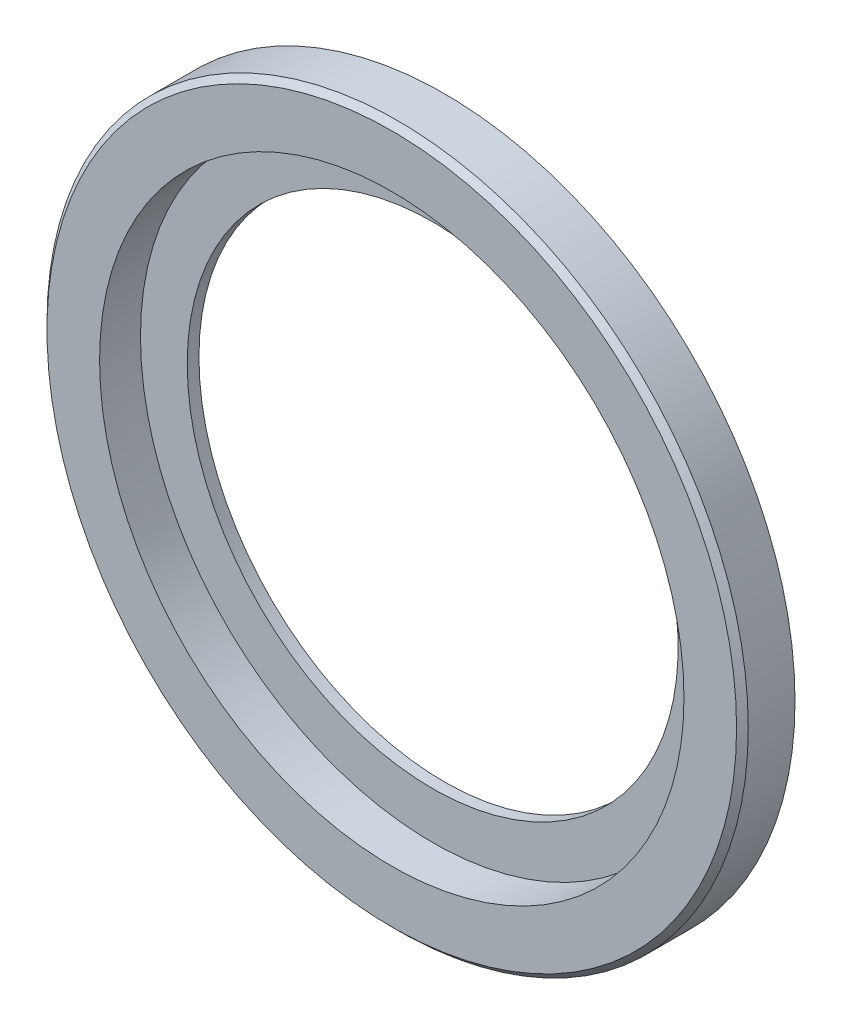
ISO-10303-21;
HEADER;
FILE_DESCRIPTION(('STEP AP214'),'2;1');
FILE_NAME('part.step','',(''),(''),'','','');
FILE_SCHEMA(('AUTOMOTIVE_DESIGN { 1 0 10303 214 1 1 1 1 }'));
ENDSEC;
DATA;
#1=APPLICATION_CONTEXT('core data for automotive mechanical design processes');
#2=APPLICATION_PROTOCOL_DEFINITION('international standard','automotive_design',2000,#1);
#3=PRODUCT_CONTEXT('',#1,'mechanical');
#4=PRODUCT('Part','Part','',(#3));
#5=PRODUCT_RELATED_PRODUCT_CATEGORY('part','',(#4));
#6=PRODUCT_DEFINITION_FORMATION('','',#4);
#7=PRODUCT_DEFINITION_CONTEXT('part definition',#1,'design');
#8=PRODUCT_DEFINITION('design','',#6,#7);
#9=PRODUCT_DEFINITION_SHAPE('','',#8);
#10=(LENGTH_UNIT() NAMED_UNIT(*) SI_UNIT(.MILLI.,.METRE.));
#11=(NAMED_UNIT(*) PLANE_ANGLE_UNIT() SI_UNIT($,.RADIAN.));
#12=(NAMED_UNIT(*) SI_UNIT($,.STERADIAN.) SOLID_ANGLE_UNIT());
#13=UNCERTAINTY_MEASURE_WITH_UNIT(LENGTH_MEASURE(1.E-05),#10,'distance_accuracy_value','');
#14=(GEOMETRIC_REPRESENTATION_CONTEXT(3) GLOBAL_UNCERTAINTY_ASSIGNED_CONTEXT((#13)) GLOBAL_UNIT_ASSIGNED_CONTEXT((#10,
#11,#12)) REPRESENTATION_CONTEXT('',''));
#15=CARTESIAN_POINT('',(0.,0.,0.));
#16=DIRECTION('',(0.,0.,1.));
#17=DIRECTION('',(1.,0.,0.));
#18=AXIS2_PLACEMENT_3D('',#15,#16,#17);
#19=CARTESIAN_POINT('',(0.,0.,9.));
#20=DIRECTION('',(0.,0.,-1.));
#21=DIRECTION('',(-1.,0.,0.));
#22=AXIS2_PLACEMENT_3D('',#19,#20,#21);
#23=CYLINDRICAL_SURFACE('',#22,60.);
#24=CARTESIAN_POINT('',(0.,0.,8.00000000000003));
#25=DIRECTION('',(0.,0.,1.));
#26=DIRECTION('',(1.,0.,0.));
#27=AXIS2_PLACEMENT_3D('',#24,#25,#26);
#28=CIRCLE('',#27,60.);
#29=CARTESIAN_POINT('',(60.,0.,8.00000000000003));
#30=VERTEX_POINT('',#29);
#31=EDGE_CURVE('E11',#30,#30,#28,.F.);
#32=ORIENTED_EDGE('',*,*,#31,.T.);
#33=EDGE_LOOP('',(#32));
#34=FACE_BOUND('',#33,.T.);
#35=CARTESIAN_POINT('',(0.,0.,0.));
#36=DIRECTION('',(0.,0.,1.));
#37=DIRECTION('',(1.,0.,0.));
#38=AXIS2_PLACEMENT_3D('',#35,#36,#37);
#39=CIRCLE('',#38,60.);
#40=CARTESIAN_POINT('',(60.,0.,0.));
#41=VERTEX_POINT('',#40);
#42=EDGE_CURVE('E170',#41,#41,#39,.T.);
#43=ORIENTED_EDGE('',*,*,#42,.T.);
#44=EDGE_LOOP('',(#43));
#45=FACE_BOUND('',#44,.T.);
#46=ADVANCED_FACE('F43',(#34,#45),#23,.T.);
#47=CARTESIAN_POINT('',(0.,0.,9.));
#48=DIRECTION('',(0.,0.,1.));
#49=DIRECTION('',(1.,0.,0.));
#50=AXIS2_PLACEMENT_3D('',#47,#48,#49);
#51=PLANE('',#50);
#52=CARTESIAN_POINT('',(0.,0.,9.));
#53=DIRECTION('',(0.,0.,1.));
#54=DIRECTION('',(1.,0.,0.));
#55=AXIS2_PLACEMENT_3D('',#52,#53,#54);
#56=CIRCLE('',#55,59.);
#57=CARTESIAN_POINT('',(59.,0.,9.));
#58=VERTEX_POINT('',#57);
#59=EDGE_CURVE('E55',#58,#58,#56,.T.);
#60=ORIENTED_EDGE('',*,*,#59,.T.);
#61=EDGE_LOOP('',(#60));
#62=FACE_BOUND('',#61,.T.);
#63=CARTESIAN_POINT('',(0.,0.,9.));
#64=DIRECTION('',(0.,0.,1.));
#65=DIRECTION('',(1.,0.,0.));
#66=AXIS2_PLACEMENT_3D('',#63,#64,#65);
#67=CIRCLE('',#66,50.);
#68=CARTESIAN_POINT('',(50.,0.,9.));
#69=VERTEX_POINT('',#68);
#70=EDGE_CURVE('E161',#69,#69,#67,.T.);
#71=ORIENTED_EDGE('',*,*,#70,.F.);
#72=EDGE_LOOP('',(#71));
#73=FACE_BOUND('',#72,.T.);
#74=ADVANCED_FACE('F174',(#62,#73),#51,.T.);
#75=CARTESIAN_POINT('',(0.,0.,0.));
#76=DIRECTION('',(0.,0.,1.));
#77=DIRECTION('',(1.,0.,0.));
#78=AXIS2_PLACEMENT_3D('',#75,#76,#77);
#79=PLANE('',#78);
#80=CARTESIAN_POINT('',(-38.1837661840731,38.183766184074,0.));
#81=DIRECTION('',(0.,0.,-1.));
#82=DIRECTION('',(-1.,0.,0.));
#83=AXIS2_PLACEMENT_3D('',#80,#81,#82);
#84=CIRCLE('',#83,2.525);
#85=CARTESIAN_POINT('',(-40.7087661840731,38.183766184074,0.));
#86=VERTEX_POINT('',#85);
#87=EDGE_CURVE('E94',#86,#86,#84,.T.);
#88=ORIENTED_EDGE('',*,*,#87,.F.);
#89=EDGE_LOOP('',(#88));
#90=FACE_BOUND('',#89,.T.);
#91=CARTESIAN_POINT('',(-54.,5.65619976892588E-13,0.));
#92=DIRECTION('',(0.,0.,-1.));
#93=DIRECTION('',(-1.,0.,0.));
#94=AXIS2_PLACEMENT_3D('',#91,#92,#93);
#95=CIRCLE('',#94,2.525);
#96=CARTESIAN_POINT('',(-56.525,5.65619976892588E-13,0.));
#97=VERTEX_POINT('',#96);
#98=EDGE_CURVE('E87',#97,#97,#95,.T.);
#99=ORIENTED_EDGE('',*,*,#98,.F.);
#100=EDGE_LOOP('',(#99));
#101=FACE_BOUND('',#100,.T.);
#102=CARTESIAN_POINT('',(-38.1837661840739,-38.1837661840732,0.));
#103=DIRECTION('',(0.,0.,-1.));
#104=DIRECTION('',(-1.,0.,0.));
#105=AXIS2_PLACEMENT_3D('',#102,#103,#104);
#106=CIRCLE('',#105,2.525);
#107=CARTESIAN_POINT('',(-40.7087661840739,-38.1837661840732,0.));
#108=VERTEX_POINT('',#107);
#109=EDGE_CURVE('E103',#108,#108,#106,.T.);
#110=ORIENTED_EDGE('',*,*,#109,.F.);
#111=EDGE_LOOP('',(#110));
#112=FACE_BOUND('',#111,.T.);
#113=CARTESIAN_POINT('',(0.,-54.,0.));
#114=DIRECTION('',(0.,0.,-1.));
#115=DIRECTION('',(-1.,0.,0.));
#116=AXIS2_PLACEMENT_3D('',#113,#114,#115);
#117=CIRCLE('',#116,2.525);
#118=CARTESIAN_POINT('',(-2.525,-54.,0.));
#119=VERTEX_POINT('',#118);
#120=EDGE_CURVE('E115',#119,#119,#117,.T.);
#121=ORIENTED_EDGE('',*,*,#120,.F.);
#122=EDGE_LOOP('',(#121));
#123=FACE_BOUND('',#122,.T.);
#124=CARTESIAN_POINT('',(38.1837661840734,-38.1837661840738,0.));
#125=DIRECTION('',(0.,0.,-1.));
#126=DIRECTION('',(-1.,0.,0.));
#127=AXIS2_PLACEMENT_3D('',#124,#125,#126);
#128=CIRCLE('',#127,2.525);
#129=CARTESIAN_POINT('',(35.6587661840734,-38.1837661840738,0.));
#130=VERTEX_POINT('',#129);
#131=EDGE_CURVE('E124',#130,#130,#128,.T.);
#132=ORIENTED_EDGE('',*,*,#131,.F.);
#133=EDGE_LOOP('',(#132));
#134=FACE_BOUND('',#133,.T.);
#135=CARTESIAN_POINT('',(54.,-1.88539992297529E-13,0.));
#136=DIRECTION('',(0.,0.,-1.));
#137=DIRECTION('',(-1.,0.,0.));
#138=AXIS2_PLACEMENT_3D('',#135,#136,#137);
#139=CIRCLE('',#138,2.525);
#140=CARTESIAN_POINT('',(51.475,-1.88539992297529E-13,0.));
#141=VERTEX_POINT('',#140);
#142=EDGE_CURVE('E128',#141,#141,#139,.T.);
#143=ORIENTED_EDGE('',*,*,#142,.F.);
#144=EDGE_LOOP('',(#143));
#145=FACE_BOUND('',#144,.T.);
#146=CARTESIAN_POINT('',(38.1837661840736,38.1837661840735,0.));
#147=DIRECTION('',(0.,0.,-1.));
#148=DIRECTION('',(-1.,0.,0.));
#149=AXIS2_PLACEMENT_3D('',#146,#147,#148);
#150=CIRCLE('',#149,2.525);
#151=CARTESIAN_POINT('',(35.6587661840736,38.1837661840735,0.));
#152=VERTEX_POINT('',#151);
#153=EDGE_CURVE('E138',#152,#152,#150,.T.);
#154=ORIENTED_EDGE('',*,*,#153,.F.);
#155=EDGE_LOOP('',(#154));
#156=FACE_BOUND('',#155,.T.);
#157=CARTESIAN_POINT('',(0.,54.,0.));
#158=DIRECTION('',(0.,0.,-1.));
#159=DIRECTION('',(-1.,0.,0.));
#160=AXIS2_PLACEMENT_3D('',#157,#158,#159);
#161=CIRCLE('',#160,2.525);
#162=CARTESIAN_POINT('',(-2.525,54.,0.));
#163=VERTEX_POINT('',#162);
#164=EDGE_CURVE('E146',#163,#163,#161,.T.);
#165=ORIENTED_EDGE('',*,*,#164,.F.);
#166=EDGE_LOOP('',(#165));
#167=FACE_BOUND('',#166,.T.);
#168=CARTESIAN_POINT('',(0.,0.,0.));
#169=DIRECTION('',(0.,0.,-1.));
#170=DIRECTION('',(-1.,0.,0.));
#171=AXIS2_PLACEMENT_3D('',#168,#169,#170);
#172=CIRCLE('',#171,42.);
#173=CARTESIAN_POINT('',(-42.,0.,0.));
#174=VERTEX_POINT('',#173);
#175=EDGE_CURVE('E160',#174,#174,#172,.T.);
#176=ORIENTED_EDGE('',*,*,#175,.F.);
#177=EDGE_LOOP('',(#176));
#178=FACE_BOUND('',#177,.T.);
#179=ORIENTED_EDGE('',*,*,#42,.F.);
#180=EDGE_LOOP('',(#179));
#181=FACE_BOUND('',#180,.T.);
#182=ADVANCED_FACE('F198',(#90,#101,#112,#123,#134,#145,#156,#167,#178,#181),#79,.F.);
#183=CARTESIAN_POINT('',(0.,0.,2.));
#184=DIRECTION('',(0.,0.,1.));
#185=DIRECTION('',(1.,0.,0.));
#186=AXIS2_PLACEMENT_3D('',#183,#184,#185);
#187=CYLINDRICAL_SURFACE('',#186,50.);
#188=CARTESIAN_POINT('',(0.,0.,2.));
#189=DIRECTION('',(0.,0.,1.));
#190=DIRECTION('',(1.,0.,0.));
#191=AXIS2_PLACEMENT_3D('',#188,#189,#190);
#192=CIRCLE('',#191,50.);
#193=CARTESIAN_POINT('',(50.,0.,2.));
#194=VERTEX_POINT('',#193);
#195=EDGE_CURVE('E163',#194,#194,#192,.T.);
#196=ORIENTED_EDGE('',*,*,#195,.F.);
#197=EDGE_LOOP('',(#196));
#198=FACE_BOUND('',#197,.T.);
#199=ORIENTED_EDGE('',*,*,#70,.T.);
#200=EDGE_LOOP('',(#199));
#201=FACE_BOUND('',#200,.T.);
#202=ADVANCED_FACE('F203',(#198,#201),#187,.F.);
#203=CARTESIAN_POINT('',(0.,0.,2.));
#204=DIRECTION('',(0.,0.,1.));
#205=DIRECTION('',(1.,0.,0.));
#206=AXIS2_PLACEMENT_3D('',#203,#204,#205);
#207=PLANE('',#206);
#208=CARTESIAN_POINT('',(0.,0.,2.));
#209=DIRECTION('',(0.,0.,-1.));
#210=DIRECTION('',(-1.,0.,0.));
#211=AXIS2_PLACEMENT_3D('',#208,#209,#210);
#212=CIRCLE('',#211,42.);
#213=CARTESIAN_POINT('',(-42.,0.,2.));
#214=VERTEX_POINT('',#213);
#215=EDGE_CURVE('E158',#214,#214,#212,.T.);
#216=ORIENTED_EDGE('',*,*,#215,.T.);
#217=EDGE_LOOP('',(#216));
#218=FACE_BOUND('',#217,.T.);
#219=ORIENTED_EDGE('',*,*,#195,.T.);
#220=EDGE_LOOP('',(#219));
#221=FACE_BOUND('',#220,.T.);
#222=ADVANCED_FACE('F186',(#218,#221),#207,.T.);
#223=CARTESIAN_POINT('',(0.,0.,2.));
#224=DIRECTION('',(0.,0.,-1.));
#225=DIRECTION('',(-1.,0.,0.));
#226=AXIS2_PLACEMENT_3D('',#223,#224,#225);
#227=CYLINDRICAL_SURFACE('',#226,42.);
#228=ORIENTED_EDGE('',*,*,#215,.F.);
#229=EDGE_LOOP('',(#228));
#230=FACE_BOUND('',#229,.T.);
#231=ORIENTED_EDGE('',*,*,#175,.T.);
#232=EDGE_LOOP('',(#231));
#233=FACE_BOUND('',#232,.T.);
#234=ADVANCED_FACE('F178',(#230,#233),#227,.F.);
#235=CARTESIAN_POINT('',(0.,0.,9.));
#236=DIRECTION('',(0.,0.,-1.));
#237=DIRECTION('',(-1.,0.,0.));
#238=AXIS2_PLACEMENT_3D('',#235,#236,#237);
#239=CONICAL_SURFACE('',#238,59.,0.785398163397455);
#240=ORIENTED_EDGE('',*,*,#31,.F.);
#241=EDGE_LOOP('',(#240));
#242=FACE_BOUND('',#241,.T.);
#243=ORIENTED_EDGE('',*,*,#59,.F.);
#244=EDGE_LOOP('',(#243));
#245=FACE_BOUND('',#244,.T.);
#246=ADVANCED_FACE('F46',(#242,#245),#239,.T.);
#247=CARTESIAN_POINT('',(0.,54.,6.));
#248=DIRECTION('',(0.,0.,-1.));
#249=DIRECTION('',(-1.,0.,0.));
#250=AXIS2_PLACEMENT_3D('',#247,#248,#249);
#251=CONICAL_SURFACE('',#250,2.5,1.02974425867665);
#252=CARTESIAN_POINT('',(0.,54.,7.5021515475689));
#253=VERTEX_POINT('',#252);
#254=VERTEX_LOOP('',#253);
#255=FACE_BOUND('',#254,.T.);
#256=CARTESIAN_POINT('',(0.,54.,6.));
#257=DIRECTION('',(0.,0.,-1.));
#258=DIRECTION('',(-1.,0.,0.));
#259=AXIS2_PLACEMENT_3D('',#256,#257,#258);
#260=CIRCLE('',#259,2.5);
#261=CARTESIAN_POINT('',(-2.5,54.,6.));
#262=VERTEX_POINT('',#261);
#263=EDGE_CURVE('E152',#262,#262,#260,.T.);
#264=ORIENTED_EDGE('',*,*,#263,.T.);
#265=EDGE_LOOP('',(#264));
#266=FACE_BOUND('',#265,.T.);
#267=ADVANCED_FACE('F180',(#255,#266),#251,.F.);
#268=CARTESIAN_POINT('',(0.,54.,0.));
#269=DIRECTION('',(0.,0.,-1.));
#270=DIRECTION('',(-1.,0.,0.));
#271=AXIS2_PLACEMENT_3D('',#268,#269,#270);
#272=CYLINDRICAL_SURFACE('',#271,2.5);
#273=ORIENTED_EDGE('',*,*,#263,.F.);
#274=EDGE_LOOP('',(#273));
#275=FACE_BOUND('',#274,.T.);
#276=CARTESIAN_POINT('',(0.,54.,0.0250000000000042));
#277=DIRECTION('',(0.,0.,-1.));
#278=DIRECTION('',(-1.,0.,0.));
#279=AXIS2_PLACEMENT_3D('',#276,#277,#278);
#280=CIRCLE('',#279,2.5);
#281=CARTESIAN_POINT('',(-2.5,54.,0.0250000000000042));
#282=VERTEX_POINT('',#281);
#283=EDGE_CURVE('E151',#282,#282,#280,.T.);
#284=ORIENTED_EDGE('',*,*,#283,.T.);
#285=EDGE_LOOP('',(#284));
#286=FACE_BOUND('',#285,.T.);
#287=ADVANCED_FACE('F183',(#275,#286),#272,.F.);
#288=CARTESIAN_POINT('',(0.,54.,0.));
#289=DIRECTION('',(0.,0.,-1.));
#290=DIRECTION('',(-1.,0.,0.));
#291=AXIS2_PLACEMENT_3D('',#288,#289,#290);
#292=CONICAL_SURFACE('',#291,2.525,0.785398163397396);
#293=ORIENTED_EDGE('',*,*,#283,.F.);
#294=EDGE_LOOP('',(#293));
#295=FACE_BOUND('',#294,.T.);
#296=ORIENTED_EDGE('',*,*,#164,.T.);
#297=EDGE_LOOP('',(#296));
#298=FACE_BOUND('',#297,.T.);
#299=ADVANCED_FACE('F215',(#295,#298),#292,.F.);
#300=CARTESIAN_POINT('',(38.1837661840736,38.1837661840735,6.));
#301=DIRECTION('',(0.,0.,-1.));
#302=DIRECTION('',(-1.,0.,0.));
#303=AXIS2_PLACEMENT_3D('',#300,#301,#302);
#304=CONICAL_SURFACE('',#303,2.5,1.02974425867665);
#305=CARTESIAN_POINT('',(38.1837661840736,38.1837661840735,7.5021515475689));
#306=VERTEX_POINT('',#305);
#307=VERTEX_LOOP('',#306);
#308=FACE_BOUND('',#307,.T.);
#309=CARTESIAN_POINT('',(38.1837661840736,38.1837661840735,6.));
#310=DIRECTION('',(0.,0.,-1.));
#311=DIRECTION('',(-1.,0.,0.));
#312=AXIS2_PLACEMENT_3D('',#309,#310,#311);
#313=CIRCLE('',#312,2.5);
#314=CARTESIAN_POINT('',(35.6837661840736,38.1837661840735,6.));
#315=VERTEX_POINT('',#314);
#316=EDGE_CURVE('E144',#315,#315,#313,.T.);
#317=ORIENTED_EDGE('',*,*,#316,.T.);
#318=EDGE_LOOP('',(#317));
#319=FACE_BOUND('',#318,.T.);
#320=ADVANCED_FACE('F216',(#308,#319),#304,.F.);
#321=CARTESIAN_POINT('',(38.1837661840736,38.1837661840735,0.));
#322=DIRECTION('',(0.,0.,-1.));
#323=DIRECTION('',(-1.,0.,0.));
#324=AXIS2_PLACEMENT_3D('',#321,#322,#323);
#325=CYLINDRICAL_SURFACE('',#324,2.5);
#326=ORIENTED_EDGE('',*,*,#316,.F.);
#327=EDGE_LOOP('',(#326));
#328=FACE_BOUND('',#327,.T.);
#329=CARTESIAN_POINT('',(38.1837661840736,38.1837661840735,0.0250000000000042));
#330=DIRECTION('',(0.,0.,-1.));
#331=DIRECTION('',(-1.,0.,0.));
#332=AXIS2_PLACEMENT_3D('',#329,#330,#331);
#333=CIRCLE('',#332,2.5);
#334=CARTESIAN_POINT('',(35.6837661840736,38.1837661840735,0.0250000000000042));
#335=VERTEX_POINT('',#334);
#336=EDGE_CURVE('E142',#335,#335,#333,.T.);
#337=ORIENTED_EDGE('',*,*,#336,.T.);
#338=EDGE_LOOP('',(#337));
#339=FACE_BOUND('',#338,.T.);
#340=ADVANCED_FACE('F219',(#328,#339),#325,.F.);
#341=CARTESIAN_POINT('',(38.1837661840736,38.1837661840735,0.));
#342=DIRECTION('',(0.,0.,-1.));
#343=DIRECTION('',(-1.,0.,0.));
#344=AXIS2_PLACEMENT_3D('',#341,#342,#343);
#345=CONICAL_SURFACE('',#344,2.525,0.785398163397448);
#346=ORIENTED_EDGE('',*,*,#336,.F.);
#347=EDGE_LOOP('',(#346));
#348=FACE_BOUND('',#347,.T.);
#349=ORIENTED_EDGE('',*,*,#153,.T.);
#350=EDGE_LOOP('',(#349));
#351=FACE_BOUND('',#350,.T.);
#352=ADVANCED_FACE('F224',(#348,#351),#345,.F.);
#353=CARTESIAN_POINT('',(54.,-1.88539992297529E-13,6.));
#354=DIRECTION('',(0.,0.,-1.));
#355=DIRECTION('',(-1.,0.,0.));
#356=AXIS2_PLACEMENT_3D('',#353,#354,#355);
#357=CONICAL_SURFACE('',#356,2.5,1.02974425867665);
#358=CARTESIAN_POINT('',(54.,-1.88539992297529E-13,7.5021515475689));
#359=VERTEX_POINT('',#358);
#360=VERTEX_LOOP('',#359);
#361=FACE_BOUND('',#360,.T.);
#362=CARTESIAN_POINT('',(54.,-1.88539992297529E-13,6.));
#363=DIRECTION('',(0.,0.,-1.));
#364=DIRECTION('',(-1.,0.,0.));
#365=AXIS2_PLACEMENT_3D('',#362,#363,#364);
#366=CIRCLE('',#365,2.5);
#367=CARTESIAN_POINT('',(51.5,-1.88539992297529E-13,6.));
#368=VERTEX_POINT('',#367);
#369=EDGE_CURVE('E139',#368,#368,#366,.T.);
#370=ORIENTED_EDGE('',*,*,#369,.T.);
#371=EDGE_LOOP('',(#370));
#372=FACE_BOUND('',#371,.T.);
#373=ADVANCED_FACE('F230',(#361,#372),#357,.F.);
#374=CARTESIAN_POINT('',(54.,-1.88539992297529E-13,0.));
#375=DIRECTION('',(0.,0.,-1.));
#376=DIRECTION('',(-1.,0.,0.));
#377=AXIS2_PLACEMENT_3D('',#374,#375,#376);
#378=CYLINDRICAL_SURFACE('',#377,2.5);
#379=ORIENTED_EDGE('',*,*,#369,.F.);
#380=EDGE_LOOP('',(#379));
#381=FACE_BOUND('',#380,.T.);
#382=CARTESIAN_POINT('',(54.,-1.88539992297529E-13,0.0250000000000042));
#383=DIRECTION('',(0.,0.,-1.));
#384=DIRECTION('',(-1.,0.,0.));
#385=AXIS2_PLACEMENT_3D('',#382,#383,#384);
#386=CIRCLE('',#385,2.5);
#387=CARTESIAN_POINT('',(51.5,-1.88539992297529E-13,0.0250000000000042));
#388=VERTEX_POINT('',#387);
#389=EDGE_CURVE('E131',#388,#388,#386,.T.);
#390=ORIENTED_EDGE('',*,*,#389,.T.);
#391=EDGE_LOOP('',(#390));
#392=FACE_BOUND('',#391,.T.);
#393=ADVANCED_FACE('F234',(#381,#392),#378,.F.);
#394=CARTESIAN_POINT('',(54.,-1.88539992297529E-13,0.));
#395=DIRECTION('',(0.,0.,-1.));
#396=DIRECTION('',(-1.,0.,0.));
#397=AXIS2_PLACEMENT_3D('',#394,#395,#396);
#398=CONICAL_SURFACE('',#397,2.525,0.785398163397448);
#399=ORIENTED_EDGE('',*,*,#389,.F.);
#400=EDGE_LOOP('',(#399));
#401=FACE_BOUND('',#400,.T.);
#402=ORIENTED_EDGE('',*,*,#142,.T.);
#403=EDGE_LOOP('',(#402));
#404=FACE_BOUND('',#403,.T.);
#405=ADVANCED_FACE('F232',(#401,#404),#398,.F.);
#406=CARTESIAN_POINT('',(38.1837661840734,-38.1837661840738,6.));
#407=DIRECTION('',(0.,0.,-1.));
#408=DIRECTION('',(-1.,0.,0.));
#409=AXIS2_PLACEMENT_3D('',#406,#407,#408);
#410=CONICAL_SURFACE('',#409,2.5,1.02974425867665);
#411=CARTESIAN_POINT('',(38.1837661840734,-38.1837661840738,7.5021515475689));
#412=VERTEX_POINT('',#411);
#413=VERTEX_LOOP('',#412);
#414=FACE_BOUND('',#413,.T.);
#415=CARTESIAN_POINT('',(38.1837661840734,-38.1837661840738,6.));
#416=DIRECTION('',(0.,0.,-1.));
#417=DIRECTION('',(-1.,0.,0.));
#418=AXIS2_PLACEMENT_3D('',#415,#416,#417);
#419=CIRCLE('',#418,2.5);
#420=CARTESIAN_POINT('',(35.6837661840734,-38.1837661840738,6.));
#421=VERTEX_POINT('',#420);
#422=EDGE_CURVE('E130',#421,#421,#419,.T.);
#423=ORIENTED_EDGE('',*,*,#422,.T.);
#424=EDGE_LOOP('',(#423));
#425=FACE_BOUND('',#424,.T.);
#426=ADVANCED_FACE('F239',(#414,#425),#410,.F.);
#427=CARTESIAN_POINT('',(38.1837661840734,-38.1837661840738,0.));
#428=DIRECTION('',(0.,0.,-1.));
#429=DIRECTION('',(-1.,0.,0.));
#430=AXIS2_PLACEMENT_3D('',#427,#428,#429);
#431=CYLINDRICAL_SURFACE('',#430,2.5);
#432=ORIENTED_EDGE('',*,*,#422,.F.);
#433=EDGE_LOOP('',(#432));
#434=FACE_BOUND('',#433,.T.);
#435=CARTESIAN_POINT('',(38.1837661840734,-38.1837661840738,0.0250000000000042));
#436=DIRECTION('',(0.,0.,-1.));
#437=DIRECTION('',(-1.,0.,0.));
#438=AXIS2_PLACEMENT_3D('',#435,#436,#437);
#439=CIRCLE('',#438,2.5);
#440=CARTESIAN_POINT('',(35.6837661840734,-38.1837661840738,0.0250000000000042));
#441=VERTEX_POINT('',#440);
#442=EDGE_CURVE('E123',#441,#441,#439,.T.);
#443=ORIENTED_EDGE('',*,*,#442,.T.);
#444=EDGE_LOOP('',(#443));
#445=FACE_BOUND('',#444,.T.);
#446=ADVANCED_FACE('F241',(#434,#445),#431,.F.);
#447=CARTESIAN_POINT('',(38.1837661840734,-38.1837661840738,0.));
#448=DIRECTION('',(0.,0.,-1.));
#449=DIRECTION('',(-1.,0.,0.));
#450=AXIS2_PLACEMENT_3D('',#447,#448,#449);
#451=CONICAL_SURFACE('',#450,2.525,0.785398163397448);
#452=ORIENTED_EDGE('',*,*,#442,.F.);
#453=EDGE_LOOP('',(#452));
#454=FACE_BOUND('',#453,.T.);
#455=ORIENTED_EDGE('',*,*,#131,.T.);
#456=EDGE_LOOP('',(#455));
#457=FACE_BOUND('',#456,.T.);
#458=ADVANCED_FACE('F246',(#454,#457),#451,.F.);
#459=CARTESIAN_POINT('',(0.,-54.,6.));
#460=DIRECTION('',(0.,0.,-1.));
#461=DIRECTION('',(-1.,0.,0.));
#462=AXIS2_PLACEMENT_3D('',#459,#460,#461);
#463=CONICAL_SURFACE('',#462,2.5,1.02974425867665);
#464=CARTESIAN_POINT('',(0.,-54.,7.5021515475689));
#465=VERTEX_POINT('',#464);
#466=VERTEX_LOOP('',#465);
#467=FACE_BOUND('',#466,.T.);
#468=CARTESIAN_POINT('',(0.,-54.,6.));
#469=DIRECTION('',(0.,0.,-1.));
#470=DIRECTION('',(-1.,0.,0.));
#471=AXIS2_PLACEMENT_3D('',#468,#469,#470);
#472=CIRCLE('',#471,2.5);
#473=CARTESIAN_POINT('',(-2.5,-54.,6.));
#474=VERTEX_POINT('',#473);
#475=EDGE_CURVE('E116',#474,#474,#472,.T.);
#476=ORIENTED_EDGE('',*,*,#475,.T.);
#477=EDGE_LOOP('',(#476));
#478=FACE_BOUND('',#477,.T.);
#479=ADVANCED_FACE('F253',(#467,#478),#463,.F.);
#480=CARTESIAN_POINT('',(0.,-54.,0.));
#481=DIRECTION('',(0.,0.,-1.));
#482=DIRECTION('',(-1.,0.,0.));
#483=AXIS2_PLACEMENT_3D('',#480,#481,#482);
#484=CYLINDRICAL_SURFACE('',#483,2.5);
#485=ORIENTED_EDGE('',*,*,#475,.F.);
#486=EDGE_LOOP('',(#485));
#487=FACE_BOUND('',#486,.T.);
#488=CARTESIAN_POINT('',(0.,-54.,0.0250000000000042));
#489=DIRECTION('',(0.,0.,-1.));
#490=DIRECTION('',(-1.,0.,0.));
#491=AXIS2_PLACEMENT_3D('',#488,#489,#490);
#492=CIRCLE('',#491,2.5);
#493=CARTESIAN_POINT('',(-2.5,-54.,0.0250000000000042));
#494=VERTEX_POINT('',#493);
#495=EDGE_CURVE('E113',#494,#494,#492,.T.);
#496=ORIENTED_EDGE('',*,*,#495,.T.);
#497=EDGE_LOOP('',(#496));
#498=FACE_BOUND('',#497,.T.);
#499=ADVANCED_FACE('F254',(#487,#498),#484,.F.);
#500=CARTESIAN_POINT('',(0.,-54.,0.));
#501=DIRECTION('',(0.,0.,-1.));
#502=DIRECTION('',(-1.,0.,0.));
#503=AXIS2_PLACEMENT_3D('',#500,#501,#502);
#504=CONICAL_SURFACE('',#503,2.525,0.785398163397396);
#505=ORIENTED_EDGE('',*,*,#495,.F.);
#506=EDGE_LOOP('',(#505));
#507=FACE_BOUND('',#506,.T.);
#508=ORIENTED_EDGE('',*,*,#120,.T.);
#509=EDGE_LOOP('',(#508));
#510=FACE_BOUND('',#509,.T.);
#511=ADVANCED_FACE('F259',(#507,#510),#504,.F.);
#512=CARTESIAN_POINT('',(-38.1837661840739,-38.1837661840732,6.));
#513=DIRECTION('',(0.,0.,-1.));
#514=DIRECTION('',(-1.,0.,0.));
#515=AXIS2_PLACEMENT_3D('',#512,#513,#514);
#516=CONICAL_SURFACE('',#515,2.5,1.02974425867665);
#517=CARTESIAN_POINT('',(-38.1837661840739,-38.1837661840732,7.5021515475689));
#518=VERTEX_POINT('',#517);
#519=VERTEX_LOOP('',#518);
#520=FACE_BOUND('',#519,.T.);
#521=CARTESIAN_POINT('',(-38.1837661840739,-38.1837661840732,6.));
#522=DIRECTION('',(0.,0.,-1.));
#523=DIRECTION('',(-1.,0.,0.));
#524=AXIS2_PLACEMENT_3D('',#521,#522,#523);
#525=CIRCLE('',#524,2.5);
#526=CARTESIAN_POINT('',(-40.6837661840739,-38.1837661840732,6.));
#527=VERTEX_POINT('',#526);
#528=EDGE_CURVE('E108',#527,#527,#525,.T.);
#529=ORIENTED_EDGE('',*,*,#528,.T.);
#530=EDGE_LOOP('',(#529));
#531=FACE_BOUND('',#530,.T.);
#532=ADVANCED_FACE('F263',(#520,#531),#516,.F.);
#533=CARTESIAN_POINT('',(-38.1837661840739,-38.1837661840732,0.));
#534=DIRECTION('',(0.,0.,-1.));
#535=DIRECTION('',(-1.,0.,0.));
#536=AXIS2_PLACEMENT_3D('',#533,#534,#535);
#537=CYLINDRICAL_SURFACE('',#536,2.5);
#538=ORIENTED_EDGE('',*,*,#528,.F.);
#539=EDGE_LOOP('',(#538));
#540=FACE_BOUND('',#539,.T.);
#541=CARTESIAN_POINT('',(-38.1837661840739,-38.1837661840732,0.0250000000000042));
#542=DIRECTION('',(0.,0.,-1.));
#543=DIRECTION('',(-1.,0.,0.));
#544=AXIS2_PLACEMENT_3D('',#541,#542,#543);
#545=CIRCLE('',#544,2.5);
#546=CARTESIAN_POINT('',(-40.6837661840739,-38.1837661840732,0.0250000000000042));
#547=VERTEX_POINT('',#546);
#548=EDGE_CURVE('E106',#547,#547,#545,.T.);
#549=ORIENTED_EDGE('',*,*,#548,.T.);
#550=EDGE_LOOP('',(#549));
#551=FACE_BOUND('',#550,.T.);
#552=ADVANCED_FACE('F270',(#540,#551),#537,.F.);
#553=CARTESIAN_POINT('',(-38.1837661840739,-38.1837661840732,0.));
#554=DIRECTION('',(0.,0.,-1.));
#555=DIRECTION('',(-1.,0.,0.));
#556=AXIS2_PLACEMENT_3D('',#553,#554,#555);
#557=CONICAL_SURFACE('',#556,2.525,0.785398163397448);
#558=ORIENTED_EDGE('',*,*,#548,.F.);
#559=EDGE_LOOP('',(#558));
#560=FACE_BOUND('',#559,.T.);
#561=ORIENTED_EDGE('',*,*,#109,.T.);
#562=EDGE_LOOP('',(#561));
#563=FACE_BOUND('',#562,.T.);
#564=ADVANCED_FACE('F271',(#560,#563),#557,.F.);
#565=CARTESIAN_POINT('',(-54.,5.65619976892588E-13,6.));
#566=DIRECTION('',(0.,0.,-1.));
#567=DIRECTION('',(-1.,0.,0.));
#568=AXIS2_PLACEMENT_3D('',#565,#566,#567);
#569=CONICAL_SURFACE('',#568,2.5,1.02974425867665);
#570=CARTESIAN_POINT('',(-54.,5.65619976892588E-13,7.5021515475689));
#571=VERTEX_POINT('',#570);
#572=VERTEX_LOOP('',#571);
#573=FACE_BOUND('',#572,.T.);
#574=CARTESIAN_POINT('',(-54.,5.65619976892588E-13,6.));
#575=DIRECTION('',(0.,0.,-1.));
#576=DIRECTION('',(-1.,0.,0.));
#577=AXIS2_PLACEMENT_3D('',#574,#575,#576);
#578=CIRCLE('',#577,2.5);
#579=CARTESIAN_POINT('',(-56.5,5.65619976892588E-13,6.));
#580=VERTEX_POINT('',#579);
#581=EDGE_CURVE('E99',#580,#580,#578,.T.);
#582=ORIENTED_EDGE('',*,*,#581,.T.);
#583=EDGE_LOOP('',(#582));
#584=FACE_BOUND('',#583,.T.);
#585=ADVANCED_FACE('F274',(#573,#584),#569,.F.);
#586=CARTESIAN_POINT('',(-54.,5.65619976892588E-13,0.));
#587=DIRECTION('',(0.,0.,-1.));
#588=DIRECTION('',(-1.,0.,0.));
#589=AXIS2_PLACEMENT_3D('',#586,#587,#588);
#590=CYLINDRICAL_SURFACE('',#589,2.5);
#591=ORIENTED_EDGE('',*,*,#581,.F.);
#592=EDGE_LOOP('',(#591));
#593=FACE_BOUND('',#592,.T.);
#594=CARTESIAN_POINT('',(-54.,5.65619976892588E-13,0.0250000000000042));
#595=DIRECTION('',(0.,0.,-1.));
#596=DIRECTION('',(-1.,0.,0.));
#597=AXIS2_PLACEMENT_3D('',#594,#595,#596);
#598=CIRCLE('',#597,2.5);
#599=CARTESIAN_POINT('',(-56.5,5.65619976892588E-13,0.0250000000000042));
#600=VERTEX_POINT('',#599);
#601=EDGE_CURVE('E93',#600,#600,#598,.T.);
#602=ORIENTED_EDGE('',*,*,#601,.T.);
#603=EDGE_LOOP('',(#602));
#604=FACE_BOUND('',#603,.T.);
#605=ADVANCED_FACE('F276',(#593,#604),#590,.F.);
#606=CARTESIAN_POINT('',(-54.,5.65619976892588E-13,0.));
#607=DIRECTION('',(0.,0.,-1.));
#608=DIRECTION('',(-1.,0.,0.));
#609=AXIS2_PLACEMENT_3D('',#606,#607,#608);
#610=CONICAL_SURFACE('',#609,2.525,0.785398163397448);
#611=ORIENTED_EDGE('',*,*,#601,.F.);
#612=EDGE_LOOP('',(#611));
#613=FACE_BOUND('',#612,.T.);
#614=ORIENTED_EDGE('',*,*,#98,.T.);
#615=EDGE_LOOP('',(#614));
#616=FACE_BOUND('',#615,.T.);
#617=ADVANCED_FACE('F84',(#613,#616),#610,.F.);
#618=CARTESIAN_POINT('',(-38.1837661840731,38.183766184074,6.));
#619=DIRECTION('',(0.,0.,-1.));
#620=DIRECTION('',(-1.,0.,0.));
#621=AXIS2_PLACEMENT_3D('',#618,#619,#620);
#622=CONICAL_SURFACE('',#621,2.5,1.02974425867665);
#623=CARTESIAN_POINT('',(-38.1837661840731,38.183766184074,7.5021515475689));
#624=VERTEX_POINT('',#623);
#625=VERTEX_LOOP('',#624);
#626=FACE_BOUND('',#625,.T.);
#627=CARTESIAN_POINT('',(-38.1837661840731,38.183766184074,6.));
#628=DIRECTION('',(0.,0.,-1.));
#629=DIRECTION('',(-1.,0.,0.));
#630=AXIS2_PLACEMENT_3D('',#627,#628,#629);
#631=CIRCLE('',#630,2.5);
#632=CARTESIAN_POINT('',(-40.6837661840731,38.183766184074,6.));
#633=VERTEX_POINT('',#632);
#634=EDGE_CURVE('E82',#633,#633,#631,.T.);
#635=ORIENTED_EDGE('',*,*,#634,.T.);
#636=EDGE_LOOP('',(#635));
#637=FACE_BOUND('',#636,.T.);
#638=ADVANCED_FACE('F80',(#626,#637),#622,.F.);
#639=CARTESIAN_POINT('',(-38.1837661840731,38.183766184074,0.));
#640=DIRECTION('',(0.,0.,-1.));
#641=DIRECTION('',(-1.,0.,0.));
#642=AXIS2_PLACEMENT_3D('',#639,#640,#641);
#643=CYLINDRICAL_SURFACE('',#642,2.5);
#644=ORIENTED_EDGE('',*,*,#634,.F.);
#645=EDGE_LOOP('',(#644));
#646=FACE_BOUND('',#645,.T.);
#647=CARTESIAN_POINT('',(-38.1837661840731,38.183766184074,0.0250000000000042));
#648=DIRECTION('',(0.,0.,-1.));
#649=DIRECTION('',(-1.,0.,0.));
#650=AXIS2_PLACEMENT_3D('',#647,#648,#649);
#651=CIRCLE('',#650,2.5);
#652=CARTESIAN_POINT('',(-40.6837661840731,38.183766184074,0.0250000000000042));
#653=VERTEX_POINT('',#652);
#654=EDGE_CURVE('E86',#653,#653,#651,.T.);
#655=ORIENTED_EDGE('',*,*,#654,.T.);
#656=EDGE_LOOP('',(#655));
#657=FACE_BOUND('',#656,.T.);
#658=ADVANCED_FACE('F77',(#646,#657),#643,.F.);
#659=CARTESIAN_POINT('',(-38.1837661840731,38.183766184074,0.));
#660=DIRECTION('',(0.,0.,-1.));
#661=DIRECTION('',(-1.,0.,0.));
#662=AXIS2_PLACEMENT_3D('',#659,#660,#661);
#663=CONICAL_SURFACE('',#662,2.525,0.785398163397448);
#664=ORIENTED_EDGE('',*,*,#654,.F.);
#665=EDGE_LOOP('',(#664));
#666=FACE_BOUND('',#665,.T.);
#667=ORIENTED_EDGE('',*,*,#87,.T.);
#668=EDGE_LOOP('',(#667));
#669=FACE_BOUND('',#668,.T.);
#670=ADVANCED_FACE('F288',(#666,#669),#663,.F.);
#671=CLOSED_SHELL('',(#46,#74,#182,#202,#222,#234,#246,#267,#287,#299,#320,#340,#352,#373,#393,
#405,#426,#446,#458,#479,#499,#511,#532,#552,#564,#585,#605,#617,#638,#658,#670));
#672=MANIFOLD_SOLID_BREP('B2',#671);
#673=ADVANCED_BREP_SHAPE_REPRESENTATION('',(#18,#672),#14);
#674=SHAPE_DEFINITION_REPRESENTATION(#9,#673);
ENDSEC;
END-ISO-10303-21;
